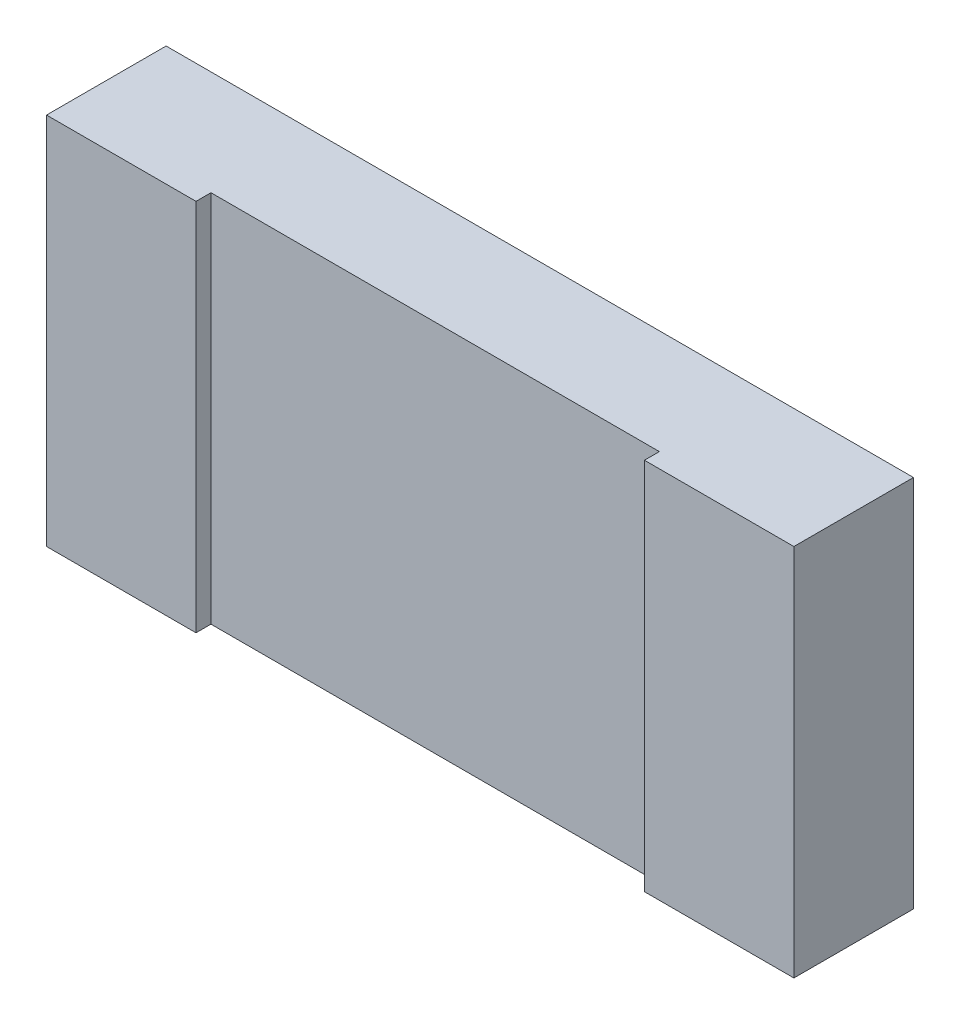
ISO-10303-21;
HEADER;
FILE_DESCRIPTION(('STEP AP214'),'2;1');
FILE_NAME('part.step','',(''),(''),'','','');
FILE_SCHEMA(('AUTOMOTIVE_DESIGN { 1 0 10303 214 1 1 1 1 }'));
ENDSEC;
DATA;
#1=APPLICATION_CONTEXT('core data for automotive mechanical design processes');
#2=APPLICATION_PROTOCOL_DEFINITION('international standard','automotive_design',2000,#1);
#3=PRODUCT_CONTEXT('',#1,'mechanical');
#4=PRODUCT('Part','Part','',(#3));
#5=PRODUCT_RELATED_PRODUCT_CATEGORY('part','',(#4));
#6=PRODUCT_DEFINITION_FORMATION('','',#4);
#7=PRODUCT_DEFINITION_CONTEXT('part definition',#1,'design');
#8=PRODUCT_DEFINITION('design','',#6,#7);
#9=PRODUCT_DEFINITION_SHAPE('','',#8);
#10=(LENGTH_UNIT() NAMED_UNIT(*) SI_UNIT(.MILLI.,.METRE.));
#11=(NAMED_UNIT(*) PLANE_ANGLE_UNIT() SI_UNIT($,.RADIAN.));
#12=(NAMED_UNIT(*) SI_UNIT($,.STERADIAN.) SOLID_ANGLE_UNIT());
#13=UNCERTAINTY_MEASURE_WITH_UNIT(LENGTH_MEASURE(1.E-05),#10,'distance_accuracy_value','');
#14=(GEOMETRIC_REPRESENTATION_CONTEXT(3) GLOBAL_UNCERTAINTY_ASSIGNED_CONTEXT((#13)) GLOBAL_UNIT_ASSIGNED_CONTEXT((#10,
#11,#12)) REPRESENTATION_CONTEXT('',''));
#15=CARTESIAN_POINT('',(0.,0.,0.));
#16=DIRECTION('',(0.,0.,1.));
#17=DIRECTION('',(1.,0.,0.));
#18=AXIS2_PLACEMENT_3D('',#15,#16,#17);
#19=CARTESIAN_POINT('',(0.,0.,0.40000000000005));
#20=DIRECTION('',(0.,1.,0.));
#21=DIRECTION('',(0.,0.,1.));
#22=AXIS2_PLACEMENT_3D('',#19,#20,#21);
#23=PLANE('',#22);
#24=DIRECTION('',(0.,0.,1.));
#25=VECTOR('',#24,1.);
#26=CARTESIAN_POINT('',(0.499999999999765,0.,0.350000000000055));
#27=LINE('',#26,#25);
#28=CARTESIAN_POINT('',(0.499999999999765,0.,0.350000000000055));
#29=VERTEX_POINT('',#28);
#30=CARTESIAN_POINT('',(0.499999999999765,0.,0.40000000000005));
#31=VERTEX_POINT('',#30);
#32=EDGE_CURVE('E113',#29,#31,#27,.T.);
#33=ORIENTED_EDGE('',*,*,#32,.T.);
#34=DIRECTION('',(1.,0.,0.));
#35=VECTOR('',#34,1.);
#36=CARTESIAN_POINT('',(0.,0.,0.40000000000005));
#37=LINE('',#36,#35);
#38=CARTESIAN_POINT('',(0.,0.,0.40000000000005));
#39=VERTEX_POINT('',#38);
#40=EDGE_CURVE('E142',#39,#31,#37,.T.);
#41=ORIENTED_EDGE('',*,*,#40,.F.);
#42=DIRECTION('',(0.,0.,-1.));
#43=VECTOR('',#42,1.);
#44=CARTESIAN_POINT('',(0.,0.,0.40000000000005));
#45=LINE('',#44,#43);
#46=CARTESIAN_POINT('',(0.,0.,0.));
#47=VERTEX_POINT('',#46);
#48=EDGE_CURVE('E53',#39,#47,#45,.T.);
#49=ORIENTED_EDGE('',*,*,#48,.T.);
#50=DIRECTION('',(1.,0.,0.));
#51=VECTOR('',#50,1.);
#52=CARTESIAN_POINT('',(0.,0.,0.));
#53=LINE('',#52,#51);
#54=CARTESIAN_POINT('',(2.50000000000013,0.,0.));
#55=VERTEX_POINT('',#54);
#56=EDGE_CURVE('E130',#47,#55,#53,.T.);
#57=ORIENTED_EDGE('',*,*,#56,.T.);
#58=DIRECTION('',(0.,0.,-1.));
#59=VECTOR('',#58,1.);
#60=CARTESIAN_POINT('',(2.50000000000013,0.,0.40000000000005));
#61=LINE('',#60,#59);
#62=CARTESIAN_POINT('',(2.50000000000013,0.,0.40000000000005));
#63=VERTEX_POINT('',#62);
#64=EDGE_CURVE('E149',#63,#55,#61,.T.);
#65=ORIENTED_EDGE('',*,*,#64,.F.);
#66=CARTESIAN_POINT('',(2.,0.,0.40000000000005));
#67=VERTEX_POINT('',#66);
#68=EDGE_CURVE('E112',#67,#63,#37,.T.);
#69=ORIENTED_EDGE('',*,*,#68,.F.);
#70=DIRECTION('',(0.,0.,-1.));
#71=VECTOR('',#70,1.);
#72=CARTESIAN_POINT('',(2.,0.,0.65000000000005));
#73=LINE('',#72,#71);
#74=CARTESIAN_POINT('',(2.,0.,0.350000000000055));
#75=VERTEX_POINT('',#74);
#76=EDGE_CURVE('E45',#67,#75,#73,.T.);
#77=ORIENTED_EDGE('',*,*,#76,.T.);
#78=DIRECTION('',(1.,0.,0.));
#79=VECTOR('',#78,1.);
#80=CARTESIAN_POINT('',(0.499999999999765,0.,0.350000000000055));
#81=LINE('',#80,#79);
#82=EDGE_CURVE('E103',#29,#75,#81,.T.);
#83=ORIENTED_EDGE('',*,*,#82,.F.);
#84=EDGE_LOOP('',(#33,#41,#49,#57,#65,#69,#77,#83));
#85=FACE_BOUND('',#84,.T.);
#86=ADVANCED_FACE('F31',(#85),#23,.F.);
#87=CARTESIAN_POINT('',(2.50000000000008,1.24999999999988,0.40000000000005));
#88=DIRECTION('',(0.,-1.,0.));
#89=DIRECTION('',(1.,0.,0.));
#90=AXIS2_PLACEMENT_3D('',#87,#88,#89);
#91=PLANE('',#90);
#92=DIRECTION('',(0.,0.,1.));
#93=VECTOR('',#92,1.);
#94=CARTESIAN_POINT('',(0.499999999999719,1.24999999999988,0.40000000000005));
#95=LINE('',#94,#93);
#96=CARTESIAN_POINT('',(0.499999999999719,1.24999999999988,0.350000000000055));
#97=VERTEX_POINT('',#96);
#98=CARTESIAN_POINT('',(0.499999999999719,1.24999999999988,0.40000000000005));
#99=VERTEX_POINT('',#98);
#100=EDGE_CURVE('E119',#97,#99,#95,.T.);
#101=ORIENTED_EDGE('',*,*,#100,.F.);
#102=DIRECTION('',(1.,0.,0.));
#103=VECTOR('',#102,1.);
#104=CARTESIAN_POINT('',(2.50000000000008,1.24999999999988,0.350000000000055));
#105=LINE('',#104,#103);
#106=CARTESIAN_POINT('',(1.99999999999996,1.24999999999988,0.350000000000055));
#107=VERTEX_POINT('',#106);
#108=EDGE_CURVE('E11',#97,#107,#105,.T.);
#109=ORIENTED_EDGE('',*,*,#108,.T.);
#110=DIRECTION('',(0.,0.,-1.));
#111=VECTOR('',#110,1.);
#112=CARTESIAN_POINT('',(1.99999999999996,1.24999999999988,0.40000000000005));
#113=LINE('',#112,#111);
#114=CARTESIAN_POINT('',(1.99999999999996,1.24999999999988,0.40000000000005));
#115=VERTEX_POINT('',#114);
#116=EDGE_CURVE('E98',#115,#107,#113,.T.);
#117=ORIENTED_EDGE('',*,*,#116,.F.);
#118=DIRECTION('',(-1.,0.,0.));
#119=VECTOR('',#118,1.);
#120=CARTESIAN_POINT('',(2.50000000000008,1.24999999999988,0.40000000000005));
#121=LINE('',#120,#119);
#122=CARTESIAN_POINT('',(2.50000000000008,1.24999999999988,0.40000000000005));
#123=VERTEX_POINT('',#122);
#124=EDGE_CURVE('E136',#123,#115,#121,.T.);
#125=ORIENTED_EDGE('',*,*,#124,.F.);
#126=DIRECTION('',(0.,0.,-1.));
#127=VECTOR('',#126,1.);
#128=CARTESIAN_POINT('',(2.50000000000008,1.24999999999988,0.40000000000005));
#129=LINE('',#128,#127);
#130=CARTESIAN_POINT('',(2.50000000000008,1.24999999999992,0.));
#131=VERTEX_POINT('',#130);
#132=EDGE_CURVE('E147',#123,#131,#129,.T.);
#133=ORIENTED_EDGE('',*,*,#132,.T.);
#134=DIRECTION('',(-1.,0.,0.));
#135=VECTOR('',#134,1.);
#136=CARTESIAN_POINT('',(2.50000000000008,1.24999999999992,0.));
#137=LINE('',#136,#135);
#138=CARTESIAN_POINT('',(0.,1.24999999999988,0.));
#139=VERTEX_POINT('',#138);
#140=EDGE_CURVE('E124',#131,#139,#137,.T.);
#141=ORIENTED_EDGE('',*,*,#140,.T.);
#142=DIRECTION('',(0.,0.,-1.));
#143=VECTOR('',#142,1.);
#144=CARTESIAN_POINT('',(0.,1.24999999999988,0.40000000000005));
#145=LINE('',#144,#143);
#146=CARTESIAN_POINT('',(0.,1.24999999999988,0.40000000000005));
#147=VERTEX_POINT('',#146);
#148=EDGE_CURVE('E145',#147,#139,#145,.T.);
#149=ORIENTED_EDGE('',*,*,#148,.F.);
#150=EDGE_CURVE('E135',#99,#147,#121,.T.);
#151=ORIENTED_EDGE('',*,*,#150,.F.);
#152=EDGE_LOOP('',(#101,#109,#117,#125,#133,#141,#149,#151));
#153=FACE_BOUND('',#152,.T.);
#154=ADVANCED_FACE('F169',(#153),#91,.F.);
#155=CARTESIAN_POINT('',(0.,0.,0.40000000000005));
#156=DIRECTION('',(0.,0.,-1.));
#157=DIRECTION('',(-1.,0.,0.));
#158=AXIS2_PLACEMENT_3D('',#155,#156,#157);
#159=PLANE('',#158);
#160=DIRECTION('',(0.,-1.,0.));
#161=VECTOR('',#160,1.);
#162=CARTESIAN_POINT('',(0.499999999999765,0.,0.40000000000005));
#163=LINE('',#162,#161);
#164=EDGE_CURVE('E38',#99,#31,#163,.T.);
#165=ORIENTED_EDGE('',*,*,#164,.F.);
#166=ORIENTED_EDGE('',*,*,#150,.T.);
#167=DIRECTION('',(0.,1.,0.));
#168=VECTOR('',#167,1.);
#169=CARTESIAN_POINT('',(0.,0.,0.40000000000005));
#170=LINE('',#169,#168);
#171=EDGE_CURVE('E133',#39,#147,#170,.T.);
#172=ORIENTED_EDGE('',*,*,#171,.F.);
#173=ORIENTED_EDGE('',*,*,#40,.T.);
#174=EDGE_LOOP('',(#165,#166,#172,#173));
#175=FACE_BOUND('',#174,.T.);
#176=ADVANCED_FACE('F160',(#175),#159,.F.);
#177=DIRECTION('',(0.,1.,0.));
#178=VECTOR('',#177,1.);
#179=CARTESIAN_POINT('',(2.,0.,0.40000000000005));
#180=LINE('',#179,#178);
#181=EDGE_CURVE('E152',#67,#115,#180,.T.);
#182=ORIENTED_EDGE('',*,*,#181,.F.);
#183=ORIENTED_EDGE('',*,*,#68,.T.);
#184=DIRECTION('',(0.,-1.,0.));
#185=VECTOR('',#184,1.);
#186=CARTESIAN_POINT('',(2.50000000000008,1.24999999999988,0.40000000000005));
#187=LINE('',#186,#185);
#188=EDGE_CURVE('E139',#123,#63,#187,.T.);
#189=ORIENTED_EDGE('',*,*,#188,.F.);
#190=ORIENTED_EDGE('',*,*,#124,.T.);
#191=EDGE_LOOP('',(#182,#183,#189,#190));
#192=FACE_BOUND('',#191,.T.);
#193=ADVANCED_FACE('F175',(#192),#159,.F.);
#194=CARTESIAN_POINT('',(0.,0.,0.40000000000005));
#195=DIRECTION('',(-1.,0.,0.));
#196=DIRECTION('',(0.,0.,1.));
#197=AXIS2_PLACEMENT_3D('',#194,#195,#196);
#198=PLANE('',#197);
#199=ORIENTED_EDGE('',*,*,#48,.F.);
#200=ORIENTED_EDGE('',*,*,#171,.T.);
#201=ORIENTED_EDGE('',*,*,#148,.T.);
#202=DIRECTION('',(0.,1.,0.));
#203=VECTOR('',#202,1.);
#204=CARTESIAN_POINT('',(0.,0.,0.));
#205=LINE('',#204,#203);
#206=EDGE_CURVE('E121',#47,#139,#205,.T.);
#207=ORIENTED_EDGE('',*,*,#206,.F.);
#208=EDGE_LOOP('',(#199,#200,#201,#207));
#209=FACE_BOUND('',#208,.T.);
#210=ADVANCED_FACE('F162',(#209),#198,.T.);
#211=CARTESIAN_POINT('',(2.50000000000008,1.24999999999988,0.40000000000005));
#212=DIRECTION('',(1.,0.,0.));
#213=DIRECTION('',(0.,0.,-1.));
#214=AXIS2_PLACEMENT_3D('',#211,#212,#213);
#215=PLANE('',#214);
#216=ORIENTED_EDGE('',*,*,#132,.F.);
#217=ORIENTED_EDGE('',*,*,#188,.T.);
#218=ORIENTED_EDGE('',*,*,#64,.T.);
#219=DIRECTION('',(0.,-1.,0.));
#220=VECTOR('',#219,1.);
#221=CARTESIAN_POINT('',(2.50000000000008,1.24999999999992,0.));
#222=LINE('',#221,#220);
#223=EDGE_CURVE('E127',#131,#55,#222,.T.);
#224=ORIENTED_EDGE('',*,*,#223,.F.);
#225=EDGE_LOOP('',(#216,#217,#218,#224));
#226=FACE_BOUND('',#225,.T.);
#227=ADVANCED_FACE('F173',(#226),#215,.T.);
#228=CARTESIAN_POINT('',(0.,0.,0.));
#229=DIRECTION('',(0.,0.,-1.));
#230=DIRECTION('',(-1.,0.,0.));
#231=AXIS2_PLACEMENT_3D('',#228,#229,#230);
#232=PLANE('',#231);
#233=ORIENTED_EDGE('',*,*,#206,.T.);
#234=ORIENTED_EDGE('',*,*,#140,.F.);
#235=ORIENTED_EDGE('',*,*,#223,.T.);
#236=ORIENTED_EDGE('',*,*,#56,.F.);
#237=EDGE_LOOP('',(#233,#234,#235,#236));
#238=FACE_BOUND('',#237,.T.);
#239=ADVANCED_FACE('F167',(#238),#232,.T.);
#240=CARTESIAN_POINT('',(0.499999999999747,6.50000000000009,0.350000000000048));
#241=DIRECTION('',(0.,0.,-1.));
#242=DIRECTION('',(-1.,0.,0.));
#243=AXIS2_PLACEMENT_3D('',#240,#241,#242);
#244=PLANE('',#243);
#245=DIRECTION('',(0.,-1.,0.));
#246=VECTOR('',#245,1.);
#247=CARTESIAN_POINT('',(0.499999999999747,6.50000000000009,0.350000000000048));
#248=LINE('',#247,#246);
#249=EDGE_CURVE('E100',#97,#29,#248,.T.);
#250=ORIENTED_EDGE('',*,*,#249,.T.);
#251=ORIENTED_EDGE('',*,*,#82,.T.);
#252=DIRECTION('',(0.,-1.,0.));
#253=VECTOR('',#252,1.);
#254=CARTESIAN_POINT('',(1.99999999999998,6.5000000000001,0.350000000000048));
#255=LINE('',#254,#253);
#256=EDGE_CURVE('E94',#107,#75,#255,.T.);
#257=ORIENTED_EDGE('',*,*,#256,.F.);
#258=ORIENTED_EDGE('',*,*,#108,.F.);
#259=EDGE_LOOP('',(#250,#251,#257,#258));
#260=FACE_BOUND('',#259,.T.);
#261=ADVANCED_FACE('F104',(#260),#244,.F.);
#262=CARTESIAN_POINT('',(0.499999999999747,6.50000000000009,0.350000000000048));
#263=DIRECTION('',(1.,0.,0.));
#264=DIRECTION('',(0.,0.,-1.));
#265=AXIS2_PLACEMENT_3D('',#262,#263,#264);
#266=PLANE('',#265);
#267=ORIENTED_EDGE('',*,*,#100,.T.);
#268=ORIENTED_EDGE('',*,*,#164,.T.);
#269=ORIENTED_EDGE('',*,*,#32,.F.);
#270=ORIENTED_EDGE('',*,*,#249,.F.);
#271=EDGE_LOOP('',(#267,#268,#269,#270));
#272=FACE_BOUND('',#271,.T.);
#273=ADVANCED_FACE('F155',(#272),#266,.T.);
#274=CARTESIAN_POINT('',(1.99999999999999,6.5000000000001,0.65000000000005));
#275=DIRECTION('',(-1.,0.,0.));
#276=DIRECTION('',(0.,0.,1.));
#277=AXIS2_PLACEMENT_3D('',#274,#275,#276);
#278=PLANE('',#277);
#279=ORIENTED_EDGE('',*,*,#116,.T.);
#280=ORIENTED_EDGE('',*,*,#256,.T.);
#281=ORIENTED_EDGE('',*,*,#76,.F.);
#282=ORIENTED_EDGE('',*,*,#181,.T.);
#283=EDGE_LOOP('',(#279,#280,#281,#282));
#284=FACE_BOUND('',#283,.T.);
#285=ADVANCED_FACE('F96',(#284),#278,.T.);
#286=CLOSED_SHELL('',(#86,#154,#176,#193,#210,#227,#239,#261,#273,#285));
#287=MANIFOLD_SOLID_BREP('B2',#286);
#288=ADVANCED_BREP_SHAPE_REPRESENTATION('',(#18,#287),#14);
#289=SHAPE_DEFINITION_REPRESENTATION(#9,#288);
ENDSEC;
END-ISO-10303-21;
